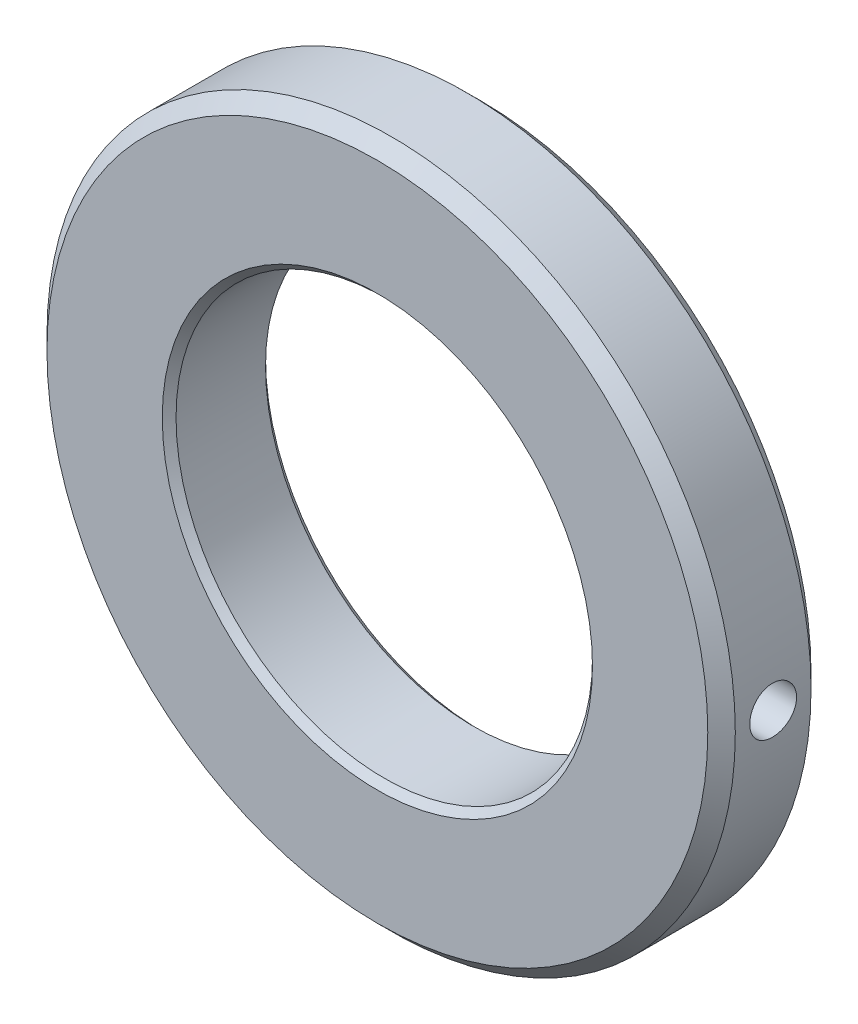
ISO-10303-21;
HEADER;
FILE_DESCRIPTION(('STEP AP214'),'2;1');
FILE_NAME('part.step','',(''),(''),'','','');
FILE_SCHEMA(('AUTOMOTIVE_DESIGN { 1 0 10303 214 1 1 1 1 }'));
ENDSEC;
DATA;
#1=APPLICATION_CONTEXT('core data for automotive mechanical design processes');
#2=APPLICATION_PROTOCOL_DEFINITION('international standard','automotive_design',2000,#1);
#3=PRODUCT_CONTEXT('',#1,'mechanical');
#4=PRODUCT('Part','Part','',(#3));
#5=PRODUCT_RELATED_PRODUCT_CATEGORY('part','',(#4));
#6=PRODUCT_DEFINITION_FORMATION('','',#4);
#7=PRODUCT_DEFINITION_CONTEXT('part definition',#1,'design');
#8=PRODUCT_DEFINITION('design','',#6,#7);
#9=PRODUCT_DEFINITION_SHAPE('','',#8);
#10=(LENGTH_UNIT() NAMED_UNIT(*) SI_UNIT(.MILLI.,.METRE.));
#11=(NAMED_UNIT(*) PLANE_ANGLE_UNIT() SI_UNIT($,.RADIAN.));
#12=(NAMED_UNIT(*) SI_UNIT($,.STERADIAN.) SOLID_ANGLE_UNIT());
#13=UNCERTAINTY_MEASURE_WITH_UNIT(LENGTH_MEASURE(1.E-05),#10,'distance_accuracy_value','');
#14=(GEOMETRIC_REPRESENTATION_CONTEXT(3) GLOBAL_UNCERTAINTY_ASSIGNED_CONTEXT((#13)) GLOBAL_UNIT_ASSIGNED_CONTEXT((#10,
#11,#12)) REPRESENTATION_CONTEXT('',''));
#15=CARTESIAN_POINT('',(0.,0.,0.));
#16=DIRECTION('',(0.,0.,1.));
#17=DIRECTION('',(1.,0.,0.));
#18=AXIS2_PLACEMENT_3D('',#15,#16,#17);
#19=CARTESIAN_POINT('',(0.,-1.11022302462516E-13,7.50000000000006));
#20=DIRECTION('',(0.,0.,0.999999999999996));
#21=DIRECTION('',(0.999999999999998,0.,0.));
#22=AXIS2_PLACEMENT_3D('',#19,#20,#21);
#23=PLANE('',#22);
#24=CARTESIAN_POINT('',(0.,-1.11022302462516E-13,7.50000000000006));
#25=DIRECTION('',(0.,0.,0.999999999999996));
#26=DIRECTION('',(0.999999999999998,0.,0.));
#27=AXIS2_PLACEMENT_3D('',#24,#25,#26);
#28=CIRCLE('',#27,48.);
#29=CARTESIAN_POINT('',(-47.9999999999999,-1.08357767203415E-13,7.50000000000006));
#30=VERTEX_POINT('',#29);
#31=EDGE_CURVE('E117',#30,#30,#28,.T.);
#32=ORIENTED_EDGE('',*,*,#31,.T.);
#33=EDGE_LOOP('',(#32));
#34=FACE_BOUND('',#33,.T.);
#35=CARTESIAN_POINT('',(0.,-1.11022302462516E-13,7.50000000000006));
#36=DIRECTION('',(0.,0.,0.999999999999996));
#37=DIRECTION('',(0.999999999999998,0.,0.));
#38=AXIS2_PLACEMENT_3D('',#35,#36,#37);
#39=CIRCLE('',#38,31.25);
#40=CARTESIAN_POINT('',(31.25,0.,7.50000000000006));
#41=VERTEX_POINT('',#40);
#42=EDGE_CURVE('E120',#41,#41,#39,.F.);
#43=ORIENTED_EDGE('',*,*,#42,.T.);
#44=EDGE_LOOP('',(#43));
#45=FACE_BOUND('',#44,.T.);
#46=ADVANCED_FACE('F40',(#34,#45),#23,.T.);
#47=CARTESIAN_POINT('',(0.,0.,-7.50000000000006));
#48=DIRECTION('',(0.,0.,0.999999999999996));
#49=DIRECTION('',(0.999999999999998,0.,0.));
#50=AXIS2_PLACEMENT_3D('',#47,#48,#49);
#51=PLANE('',#50);
#52=CARTESIAN_POINT('',(0.,0.,-7.50000000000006));
#53=DIRECTION('',(0.,0.,0.999999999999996));
#54=DIRECTION('',(0.999999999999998,0.,0.));
#55=AXIS2_PLACEMENT_3D('',#52,#53,#54);
#56=CIRCLE('',#55,48.);
#57=CARTESIAN_POINT('',(47.9999999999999,0.,-7.50000000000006));
#58=VERTEX_POINT('',#57);
#59=EDGE_CURVE('E11',#58,#58,#56,.F.);
#60=ORIENTED_EDGE('',*,*,#59,.T.);
#61=EDGE_LOOP('',(#60));
#62=FACE_BOUND('',#61,.T.);
#63=CARTESIAN_POINT('',(0.,0.,-7.50000000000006));
#64=DIRECTION('',(0.,0.,0.999999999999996));
#65=DIRECTION('',(0.999999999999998,0.,0.));
#66=AXIS2_PLACEMENT_3D('',#63,#64,#65);
#67=CIRCLE('',#66,31.25);
#68=CARTESIAN_POINT('',(-31.2499999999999,0.,-7.50000000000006));
#69=VERTEX_POINT('',#68);
#70=EDGE_CURVE('E122',#69,#69,#67,.T.);
#71=ORIENTED_EDGE('',*,*,#70,.T.);
#72=EDGE_LOOP('',(#71));
#73=FACE_BOUND('',#72,.T.);
#74=ADVANCED_FACE('F107',(#62,#73),#51,.F.);
#75=CARTESIAN_POINT('',(0.,-1.11022302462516E-13,7.50000000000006));
#76=DIRECTION('',(0.,0.,-0.999999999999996));
#77=DIRECTION('',(-0.999999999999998,0.,0.));
#78=AXIS2_PLACEMENT_3D('',#75,#76,#77);
#79=CYLINDRICAL_SURFACE('',#78,50.);
#80=CARTESIAN_POINT('',(50.,0.,-3.39999999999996));
#81=CARTESIAN_POINT('',(49.9999984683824,-0.190743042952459,-3.39999162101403));
#82=CARTESIAN_POINT('',(49.998896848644,-0.381618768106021,-3.38389476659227));
#83=CARTESIAN_POINT('',(49.9946081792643,-0.758097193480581,-3.31991367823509));
#84=CARTESIAN_POINT('',(49.9914187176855,-0.943693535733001,-3.27199267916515));
#85=CARTESIAN_POINT('',(49.9833150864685,-1.30410556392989,-3.14574829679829));
#86=CARTESIAN_POINT('',(49.9784018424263,-1.47892697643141,-3.06744122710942));
#87=CARTESIAN_POINT('',(49.9674028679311,-1.81289938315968,-2.88267467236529));
#88=CARTESIAN_POINT('',(49.9613174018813,-1.9720538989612,-2.77622153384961));
#89=CARTESIAN_POINT('',(49.9486458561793,-2.27049745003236,-2.53798189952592));
#90=CARTESIAN_POINT('',(49.9420590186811,-2.40975545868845,-2.40615657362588));
#91=CARTESIAN_POINT('',(49.9291335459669,-2.66418736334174,-2.12099531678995));
#92=CARTESIAN_POINT('',(49.9227949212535,-2.77936024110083,-1.96765847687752));
#93=CARTESIAN_POINT('',(49.9110747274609,-2.98245119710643,-1.64364724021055));
#94=CARTESIAN_POINT('',(49.9056940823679,-3.07034302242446,-1.47295635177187));
#95=CARTESIAN_POINT('',(49.8965066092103,-3.21620906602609,-1.11919774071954));
#96=CARTESIAN_POINT('',(49.8926997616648,-3.27418365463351,-0.93613017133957));
#97=CARTESIAN_POINT('',(49.8870965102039,-3.35848216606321,-0.563117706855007));
#98=CARTESIAN_POINT('',(49.8852969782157,-3.38485533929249,-0.3731839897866));
#99=CARTESIAN_POINT('',(49.8839019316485,-3.40535444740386,0.00842235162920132));
#100=CARTESIAN_POINT('',(49.884306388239,-3.3994808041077,0.200094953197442));
#101=CARTESIAN_POINT('',(49.887270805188,-3.35569383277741,0.579402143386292));
#102=CARTESIAN_POINT('',(49.8898271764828,-3.31783385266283,0.767042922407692));
#103=CARTESIAN_POINT('',(49.8968017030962,-3.211231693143,1.13329996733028));
#104=CARTESIAN_POINT('',(49.9012198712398,-3.14248930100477,1.31191617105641));
#105=CARTESIAN_POINT('',(49.911424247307,-2.97601329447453,1.65522487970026));
#106=CARTESIAN_POINT('',(49.9172115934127,-2.87825554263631,1.81990564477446));
#107=CARTESIAN_POINT('',(49.9295010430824,-2.65654126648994,2.13054044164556));
#108=CARTESIAN_POINT('',(49.9360031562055,-2.53258439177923,2.27649422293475));
#109=CARTESIAN_POINT('',(49.9490053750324,-2.26169038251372,2.54584229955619));
#110=CARTESIAN_POINT('',(49.9555054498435,-2.11470709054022,2.66919017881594));
#111=CARTESIAN_POINT('',(49.9677584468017,-1.80209418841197,2.88946682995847));
#112=CARTESIAN_POINT('',(49.9735113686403,-1.63646457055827,2.98639559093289));
#113=CARTESIAN_POINT('',(49.9836224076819,-1.29123200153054,3.15107887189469));
#114=CARTESIAN_POINT('',(49.9879804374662,-1.11162817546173,3.21883156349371));
#115=CARTESIAN_POINT('',(49.9948094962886,-0.743558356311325,3.32320809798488));
#116=CARTESIAN_POINT('',(49.9972805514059,-0.555092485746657,3.35983237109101));
#117=CARTESIAN_POINT('',(50.0000538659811,-0.175051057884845,3.40085476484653));
#118=CARTESIAN_POINT('',(50.0003604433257,0.0165175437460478,3.40531704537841));
#119=CARTESIAN_POINT('',(49.9987817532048,0.397680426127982,3.38205652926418));
#120=CARTESIAN_POINT('',(49.9968964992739,0.587274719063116,3.35433393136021));
#121=CARTESIAN_POINT('',(49.9911491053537,0.958925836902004,3.26754373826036));
#122=CARTESIAN_POINT('',(49.9872888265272,1.14098958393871,3.2085056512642));
#123=CARTESIAN_POINT('',(49.9780255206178,1.49262532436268,3.06079036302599));
#124=CARTESIAN_POINT('',(49.972622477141,1.66219718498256,2.97211284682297));
#125=CARTESIAN_POINT('',(49.960869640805,1.98432901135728,2.76747309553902));
#126=CARTESIAN_POINT('',(49.9545183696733,2.13686175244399,2.65146809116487));
#127=CARTESIAN_POINT('',(49.9415885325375,2.42031125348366,2.39552846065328));
#128=CARTESIAN_POINT('',(49.9350099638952,2.55122776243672,2.25559355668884));
#129=CARTESIAN_POINT('',(49.9223544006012,2.78794655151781,1.95548917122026));
#130=CARTESIAN_POINT('',(49.9162782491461,2.89370714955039,1.79528677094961));
#131=CARTESIAN_POINT('',(49.9053262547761,3.07682668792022,1.45936001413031));
#132=CARTESIAN_POINT('',(49.9004504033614,3.15418582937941,1.28363576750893));
#133=CARTESIAN_POINT('',(49.8924549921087,3.27823460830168,0.921804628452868));
#134=CARTESIAN_POINT('',(49.8893339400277,3.32495030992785,0.73570670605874));
#135=CARTESIAN_POINT('',(49.8851959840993,3.38647118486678,0.358286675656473));
#136=CARTESIAN_POINT('',(49.8841790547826,3.40127674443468,0.16696463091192));
#137=CARTESIAN_POINT('',(49.8843646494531,3.39855319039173,-0.215058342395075));
#138=CARTESIAN_POINT('',(49.88556267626,3.38108959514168,-0.405759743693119));
#139=CARTESIAN_POINT('',(49.890033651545,3.31445948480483,-0.781515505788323));
#140=CARTESIAN_POINT('',(49.8933066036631,3.26529291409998,-0.966569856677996));
#141=CARTESIAN_POINT('',(49.9015574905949,3.13666775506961,-1.32578691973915));
#142=CARTESIAN_POINT('',(49.9065353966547,3.05720967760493,-1.49994981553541));
#143=CARTESIAN_POINT('',(49.917635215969,2.87026546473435,-1.83247249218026));
#144=CARTESIAN_POINT('',(49.9237571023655,2.76277998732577,-1.9908326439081));
#145=CARTESIAN_POINT('',(49.9364696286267,2.52258822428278,-2.28758797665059));
#146=CARTESIAN_POINT('',(49.9430611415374,2.38983415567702,-2.42594444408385));
#147=CARTESIAN_POINT('',(49.9559625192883,2.10294578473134,-2.67845840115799));
#148=CARTESIAN_POINT('',(49.9622723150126,1.94880627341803,-2.79260997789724));
#149=CARTESIAN_POINT('',(49.973906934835,1.62331871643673,-2.99357383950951));
#150=CARTESIAN_POINT('',(49.9792303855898,1.45194718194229,-3.08034812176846));
#151=CARTESIAN_POINT('',(49.9882747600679,1.09715369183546,-3.22378424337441));
#152=CARTESIAN_POINT('',(49.9919975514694,0.913746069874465,-3.2804811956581));
#153=CARTESIAN_POINT('',(49.9964502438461,0.607687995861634,-3.34748701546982));
#154=CARTESIAN_POINT('',(49.9977754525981,0.487013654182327,-3.36715375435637));
#155=CARTESIAN_POINT('',(49.9995508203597,0.244244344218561,-3.3934129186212));
#156=CARTESIAN_POINT('',(50.0000009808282,0.12214937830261,-3.4000053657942));
#157=CARTESIAN_POINT('',(50.,0.,-3.39999999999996));
#158=B_SPLINE_CURVE_WITH_KNOTS('',3,(#80,#81,#82,#83,#84,#85,#86,#87,#88,#89,#90,#91,#92,#93,
#94,#95,#96,#97,#98,#99,#100,#101,#102,#103,#104,#105,#106,#107,#108,#109,#110,#111,#112,#113,
#114,#115,#116,#117,#118,#119,#120,#121,#122,#123,#124,#125,#126,#127,#128,#129,#130,#131,#132,
#133,#134,#135,#136,#137,#138,#139,#140,#141,#142,#143,#144,#145,#146,#147,#148,#149,#150,#151,
#152,#153,#154,#155,#156,#157),.UNSPECIFIED.,.T.,.F.,(4,2,2,2,2,2,2,2,2,2,2,2,2,2,2,2,2,2,2,2,2,
2,2,2,2,2,2,2,2,2,2,2,2,2,2,2,2,2,4),(0.,0.571783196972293,1.1442281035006,1.71636610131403,
2.28837519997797,2.86126677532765,3.43418256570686,4.00764798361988,4.58110630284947,
5.15366972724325,5.72622566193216,6.29782854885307,6.86943537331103,7.44151904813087,
8.01361037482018,8.58686351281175,9.16011688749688,9.73340618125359,10.3066875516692,
10.8788249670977,11.4509588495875,12.0225545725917,12.594156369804,13.1666587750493,
13.7391678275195,14.3126189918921,14.8860660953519,15.459024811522,16.0319765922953,
16.6037663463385,17.1755571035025,17.7473382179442,18.3191059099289,18.8919657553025,
19.4649653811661,20.038756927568,20.6118771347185,20.9780403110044,21.3442028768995),.UNSPECIFIED.);
#159=CARTESIAN_POINT('',(50.,-2.4980018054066E-13,3.39999999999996));
#160=VERTEX_POINT('',#159);
#161=CARTESIAN_POINT('',(50.,0.,-3.39999999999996));
#162=VERTEX_POINT('',#161);
#163=EDGE_CURVE('E58',#160,#162,#158,.T.);
#164=ORIENTED_EDGE('',*,*,#163,.T.);
#165=EDGE_CURVE('E56',#162,#160,#158,.T.);
#166=ORIENTED_EDGE('',*,*,#165,.T.);
#167=EDGE_LOOP('',(#164,#166));
#168=FACE_BOUND('',#167,.T.);
#169=CARTESIAN_POINT('',(0.,0.,5.50000000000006));
#170=DIRECTION('',(0.,0.,0.999999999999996));
#171=DIRECTION('',(0.999999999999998,0.,0.));
#172=AXIS2_PLACEMENT_3D('',#169,#170,#171);
#173=CIRCLE('',#172,50.);
#174=CARTESIAN_POINT('',(-49.9999999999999,-1.08246744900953E-13,5.50000000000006));
#175=VERTEX_POINT('',#174);
#176=EDGE_CURVE('E50',#175,#175,#173,.F.);
#177=ORIENTED_EDGE('',*,*,#176,.T.);
#178=EDGE_LOOP('',(#177));
#179=FACE_BOUND('',#178,.T.);
#180=CARTESIAN_POINT('',(0.,0.,-5.50000000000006));
#181=DIRECTION('',(0.,0.,0.999999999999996));
#182=DIRECTION('',(0.999999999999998,0.,0.));
#183=AXIS2_PLACEMENT_3D('',#180,#181,#182);
#184=CIRCLE('',#183,50.);
#185=CARTESIAN_POINT('',(49.9999999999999,0.,-5.50000000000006));
#186=VERTEX_POINT('',#185);
#187=EDGE_CURVE('E132',#186,#186,#184,.T.);
#188=ORIENTED_EDGE('',*,*,#187,.T.);
#189=EDGE_LOOP('',(#188));
#190=FACE_BOUND('',#189,.T.);
#191=ADVANCED_FACE('F42',(#168,#179,#190),#79,.T.);
#192=CARTESIAN_POINT('',(0.,-1.11022302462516E-13,7.50000000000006));
#193=DIRECTION('',(0.,0.,-0.999999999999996));
#194=DIRECTION('',(-0.999999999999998,0.,0.));
#195=AXIS2_PLACEMENT_3D('',#192,#193,#194);
#196=CYLINDRICAL_SURFACE('',#195,30.25);
#197=CARTESIAN_POINT('',(30.2500000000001,0.,-3.39999999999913));
#198=CARTESIAN_POINT('',(30.2499975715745,-0.190335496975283,-3.39999182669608));
#199=CARTESIAN_POINT('',(30.2481845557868,-0.380793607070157,-3.38396338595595));
#200=CARTESIAN_POINT('',(30.2411264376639,-0.756420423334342,-3.32026993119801));
#201=CARTESIAN_POINT('',(30.2358776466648,-0.941583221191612,-3.27257091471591));
#202=CARTESIAN_POINT('',(30.2225399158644,-1.3011262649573,-3.14695042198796));
#203=CARTESIAN_POINT('',(30.2144527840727,-1.47551329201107,-3.0690481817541));
#204=CARTESIAN_POINT('',(30.196340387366,-1.80870174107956,-2.88527223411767));
#205=CARTESIAN_POINT('',(30.1863154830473,-1.96750605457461,-2.77940372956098));
#206=CARTESIAN_POINT('',(30.1653984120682,-2.26577052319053,-2.54219095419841));
#207=CARTESIAN_POINT('',(30.1545029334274,-2.40515067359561,-2.41074637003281));
#208=CARTESIAN_POINT('',(30.1330997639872,-2.6599219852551,-2.12632746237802));
#209=CARTESIAN_POINT('',(30.122592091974,-2.77531198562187,-1.97335209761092));
#210=CARTESIAN_POINT('',(30.1031211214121,-2.97911832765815,-1.64970352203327));
#211=CARTESIAN_POINT('',(30.0941620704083,-3.06746097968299,-1.47898363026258));
#212=CARTESIAN_POINT('',(30.0788452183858,-3.21419436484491,-1.1250144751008));
#213=CARTESIAN_POINT('',(30.0724873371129,-3.27258602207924,-0.94176559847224));
#214=CARTESIAN_POINT('',(30.0631235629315,-3.35751967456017,-0.568763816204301));
#215=CARTESIAN_POINT('',(30.0601035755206,-3.38419562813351,-0.379041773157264));
#216=CARTESIAN_POINT('',(30.0577141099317,-3.40535493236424,0.00220867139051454));
#217=CARTESIAN_POINT('',(30.0583445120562,-3.39983933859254,0.193737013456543));
#218=CARTESIAN_POINT('',(30.0631717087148,-3.35688231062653,0.572235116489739));
#219=CARTESIAN_POINT('',(30.0673520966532,-3.31958774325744,0.759221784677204));
#220=CARTESIAN_POINT('',(30.0787826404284,-3.21436023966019,1.12426534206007));
#221=CARTESIAN_POINT('',(30.0860328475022,-3.14642679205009,1.30232208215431));
#222=CARTESIAN_POINT('',(30.1028048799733,-2.98168979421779,1.64491175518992));
#223=CARTESIAN_POINT('',(30.1123317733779,-2.88482171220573,1.80941339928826));
#224=CARTESIAN_POINT('',(30.1325796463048,-2.665011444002,2.11988067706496));
#225=CARTESIAN_POINT('',(30.1433006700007,-2.5420682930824,2.2658456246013));
#226=CARTESIAN_POINT('',(30.1648018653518,-2.27278047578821,2.53594908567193));
#227=CARTESIAN_POINT('',(30.1755820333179,-2.12630908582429,2.65996129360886));
#228=CARTESIAN_POINT('',(30.1959306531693,-1.81456086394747,2.88165796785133));
#229=CARTESIAN_POINT('',(30.2054991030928,-1.64928400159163,2.97934239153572));
#230=CARTESIAN_POINT('',(30.2223505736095,-1.30452429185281,3.14560794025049));
#231=CARTESIAN_POINT('',(30.2296330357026,-1.12503798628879,3.21418195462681));
#232=CARTESIAN_POINT('',(30.2410866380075,-0.756998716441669,3.32018395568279));
#233=CARTESIAN_POINT('',(30.2452578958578,-0.568446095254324,3.35761311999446));
#234=CARTESIAN_POINT('',(30.2500039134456,-0.188719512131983,3.40010108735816));
#235=CARTESIAN_POINT('',(30.2505980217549,0.00243473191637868,3.40533404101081));
#236=CARTESIAN_POINT('',(30.248174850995,0.382897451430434,3.38373946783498));
#237=CARTESIAN_POINT('',(30.2451576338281,0.572205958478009,3.35691249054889));
#238=CARTESIAN_POINT('',(30.2358630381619,0.943095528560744,3.27210415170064));
#239=CARTESIAN_POINT('',(30.2295942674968,1.1246956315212,3.21420503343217));
#240=CARTESIAN_POINT('',(30.2144991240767,1.47560705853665,3.06898093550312));
#241=CARTESIAN_POINT('',(30.2056726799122,1.64491803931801,2.98165513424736));
#242=CARTESIAN_POINT('',(30.1863996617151,1.96722800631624,2.77962958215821));
#243=CARTESIAN_POINT('',(30.175946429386,2.12015538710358,2.66481623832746));
#244=CARTESIAN_POINT('',(30.1546122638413,2.40463055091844,2.41123658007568));
#245=CARTESIAN_POINT('',(30.1437313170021,2.53617765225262,2.2724695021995));
#246=CARTESIAN_POINT('',(30.1227091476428,2.77476900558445,1.97415814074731));
#247=CARTESIAN_POINT('',(30.1125715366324,2.88169841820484,1.81452171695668));
#248=CARTESIAN_POINT('',(30.0942410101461,3.06722778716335,1.47945414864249));
#249=CARTESIAN_POINT('',(30.0860480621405,3.14582821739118,1.30402326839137));
#250=CARTESIAN_POINT('',(30.0725581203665,3.27227914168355,0.942729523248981));
#251=CARTESIAN_POINT('',(30.0672548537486,3.32019628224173,0.756890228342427));
#252=CARTESIAN_POINT('',(30.0601260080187,3.38413595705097,0.379740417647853));
#253=CARTESIAN_POINT('',(30.0583003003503,3.40015967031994,0.18843010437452));
#254=CARTESIAN_POINT('',(30.0583365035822,3.3998388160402,-0.193089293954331));
#255=CARTESIAN_POINT('',(30.0601778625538,3.3836746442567,-0.383298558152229));
#256=CARTESIAN_POINT('',(30.0672967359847,3.31981686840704,-0.758279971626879));
#257=CARTESIAN_POINT('',(30.0725742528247,3.27212324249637,-0.943052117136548));
#258=CARTESIAN_POINT('',(30.0859647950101,3.1466133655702,-1.30190230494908));
#259=CARTESIAN_POINT('',(30.0940771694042,3.06880402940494,-1.47598279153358));
#260=CARTESIAN_POINT('',(30.1122245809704,2.88528948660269,-1.8086435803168));
#261=CARTESIAN_POINT('',(30.1222596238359,2.77958419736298,-1.96722383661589));
#262=CARTESIAN_POINT('',(30.1431891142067,2.5426041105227,-2.26530645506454));
#263=CARTESIAN_POINT('',(30.1540878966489,2.41119475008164,-2.40470153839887));
#264=CARTESIAN_POINT('',(30.1754777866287,2.12681191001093,-2.65953537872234));
#265=CARTESIAN_POINT('',(30.1859687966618,1.97383331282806,-2.77496843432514));
#266=CARTESIAN_POINT('',(30.2053961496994,1.65012033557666,-2.97889638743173));
#267=CARTESIAN_POINT('',(30.2143275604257,1.47933225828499,-3.06730646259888));
#268=CARTESIAN_POINT('',(30.2295778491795,1.12533645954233,-3.21407085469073));
#269=CARTESIAN_POINT('',(30.2358996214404,0.94214276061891,-3.27245848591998));
#270=CARTESIAN_POINT('',(30.2436599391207,0.631627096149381,-3.34323304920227));
#271=CARTESIAN_POINT('',(30.2460261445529,0.506278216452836,-3.36449087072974));
#272=CARTESIAN_POINT('',(30.2491969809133,0.253971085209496,-3.39287703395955));
#273=CARTESIAN_POINT('',(30.2500016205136,0.127012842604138,-3.40000545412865));
#274=CARTESIAN_POINT('',(30.2500000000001,0.,-3.39999999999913));
#275=B_SPLINE_CURVE_WITH_KNOTS('',3,(#197,#198,#199,#200,#201,#202,#203,#204,#205,#206,#207,
#208,#209,#210,#211,#212,#213,#214,#215,#216,#217,#218,#219,#220,#221,#222,#223,#224,#225,#226,
#227,#228,#229,#230,#231,#232,#233,#234,#235,#236,#237,#238,#239,#240,#241,#242,#243,#244,#245,
#246,#247,#248,#249,#250,#251,#252,#253,#254,#255,#256,#257,#258,#259,#260,#261,#262,#263,#264,
#265,#266,#267,#268,#269,#270,#271,#272,#273,#274),.UNSPECIFIED.,.T.,.F.,(4,2,2,2,2,2,2,2,2,2,2,
2,2,2,2,2,2,2,2,2,2,2,2,2,2,2,2,2,2,2,2,2,2,2,2,2,2,2,4),(0.,0.570542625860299,1.14169879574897,
1.71249180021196,2.28317868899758,2.85615073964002,3.42915051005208,4.00369778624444,
4.57822733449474,5.15032150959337,5.72239692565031,6.2918427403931,6.86129805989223,
7.43203301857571,8.00278909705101,8.57672924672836,9.15067032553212,9.72475151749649,
10.2988110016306,10.86976262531,11.4407044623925,12.010142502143,12.5795964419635,
13.1514455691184,13.7233129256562,14.2977962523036,14.8722699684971,15.445491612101,
16.0186920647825,16.5886890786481,17.1586864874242,17.7285530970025,18.2984213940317,
18.871356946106,19.444428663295,20.019281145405,20.5934943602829,20.9742254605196,
21.3549544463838),.UNSPECIFIED.);
#276=CARTESIAN_POINT('',(30.2500000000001,0.,-3.39999999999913));
#277=VERTEX_POINT('',#276);
#278=EDGE_CURVE('E62',#277,#277,#275,.T.);
#279=ORIENTED_EDGE('',*,*,#278,.F.);
#280=EDGE_LOOP('',(#279));
#281=FACE_BOUND('',#280,.T.);
#282=CARTESIAN_POINT('',(0.,0.,6.49999999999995));
#283=DIRECTION('',(0.,0.,0.999999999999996));
#284=DIRECTION('',(0.999999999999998,0.,0.));
#285=AXIS2_PLACEMENT_3D('',#282,#283,#284);
#286=CIRCLE('',#285,30.25);
#287=CARTESIAN_POINT('',(30.2499999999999,0.,6.49999999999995));
#288=VERTEX_POINT('',#287);
#289=EDGE_CURVE('E71',#288,#288,#286,.T.);
#290=ORIENTED_EDGE('',*,*,#289,.T.);
#291=EDGE_LOOP('',(#290));
#292=FACE_BOUND('',#291,.T.);
#293=CARTESIAN_POINT('',(0.,0.,-6.49999999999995));
#294=DIRECTION('',(0.,0.,0.999999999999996));
#295=DIRECTION('',(0.999999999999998,0.,0.));
#296=AXIS2_PLACEMENT_3D('',#293,#294,#295);
#297=CIRCLE('',#296,30.25);
#298=CARTESIAN_POINT('',(-30.2499999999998,0.,-6.49999999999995));
#299=VERTEX_POINT('',#298);
#300=EDGE_CURVE('E66',#299,#299,#297,.F.);
#301=ORIENTED_EDGE('',*,*,#300,.T.);
#302=EDGE_LOOP('',(#301));
#303=FACE_BOUND('',#302,.T.);
#304=ADVANCED_FACE('F102',(#281,#292,#303),#196,.F.);
#305=CARTESIAN_POINT('',(0.,0.,6.49999999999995));
#306=DIRECTION('',(0.,0.,0.999999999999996));
#307=DIRECTION('',(0.999999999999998,0.,0.));
#308=AXIS2_PLACEMENT_3D('',#305,#306,#307);
#309=CONICAL_SURFACE('',#308,30.25,0.78539816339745);
#310=CARTESIAN_POINT('',(31.25,0.,7.50000000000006));
#311=CARTESIAN_POINT('',(31.2395833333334,0.,7.48958333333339));
#312=CARTESIAN_POINT('',(31.2291666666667,0.,7.47916666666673));
#313=CARTESIAN_POINT('',(31.2083333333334,0.,7.45833333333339));
#314=CARTESIAN_POINT('',(31.1979166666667,0.,7.44791666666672));
#315=CARTESIAN_POINT('',(31.1770833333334,0.,7.42708333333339));
#316=CARTESIAN_POINT('',(31.1666666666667,0.,7.41666666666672));
#317=CARTESIAN_POINT('',(31.1458333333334,0.,7.39583333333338));
#318=CARTESIAN_POINT('',(31.1354166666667,0.,7.38541666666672));
#319=CARTESIAN_POINT('',(31.1145833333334,0.,7.36458333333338));
#320=CARTESIAN_POINT('',(31.1041666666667,0.,7.35416666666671));
#321=CARTESIAN_POINT('',(31.0833333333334,0.,7.33333333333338));
#322=CARTESIAN_POINT('',(31.0729166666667,0.,7.32291666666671));
#323=CARTESIAN_POINT('',(31.0520833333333,0.,7.30208333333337));
#324=CARTESIAN_POINT('',(31.0416666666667,0.,7.29166666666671));
#325=CARTESIAN_POINT('',(31.0208333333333,0.,7.27083333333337));
#326=CARTESIAN_POINT('',(31.0104166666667,0.,7.2604166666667));
#327=CARTESIAN_POINT('',(30.9895833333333,0.,7.23958333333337));
#328=CARTESIAN_POINT('',(30.9791666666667,0.,7.2291666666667));
#329=CARTESIAN_POINT('',(30.9583333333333,0.,7.20833333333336));
#330=CARTESIAN_POINT('',(30.9479166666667,0.,7.19791666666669));
#331=CARTESIAN_POINT('',(30.9270833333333,0.,7.17708333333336));
#332=CARTESIAN_POINT('',(30.9166666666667,0.,7.16666666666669));
#333=CARTESIAN_POINT('',(30.8958333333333,0.,7.14583333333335));
#334=CARTESIAN_POINT('',(30.8854166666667,0.,7.13541666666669));
#335=CARTESIAN_POINT('',(30.8645833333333,0.,7.11458333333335));
#336=CARTESIAN_POINT('',(30.8541666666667,0.,7.10416666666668));
#337=CARTESIAN_POINT('',(30.8333333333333,0.,7.08333333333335));
#338=CARTESIAN_POINT('',(30.8229166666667,0.,7.07291666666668));
#339=CARTESIAN_POINT('',(30.8020833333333,0.,7.05208333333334));
#340=CARTESIAN_POINT('',(30.7916666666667,0.,7.04166666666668));
#341=CARTESIAN_POINT('',(30.7708333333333,0.,7.02083333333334));
#342=CARTESIAN_POINT('',(30.7604166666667,0.,7.01041666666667));
#343=CARTESIAN_POINT('',(30.7395833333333,0.,6.98958333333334));
#344=CARTESIAN_POINT('',(30.7291666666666,0.,6.97916666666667));
#345=CARTESIAN_POINT('',(30.7083333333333,0.,6.95833333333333));
#346=CARTESIAN_POINT('',(30.6979166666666,0.,6.94791666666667));
#347=CARTESIAN_POINT('',(30.6770833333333,0.,6.92708333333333));
#348=CARTESIAN_POINT('',(30.6666666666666,0.,6.91666666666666));
#349=CARTESIAN_POINT('',(30.6458333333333,0.,6.89583333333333));
#350=CARTESIAN_POINT('',(30.6354166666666,0.,6.88541666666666));
#351=CARTESIAN_POINT('',(30.6145833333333,0.,6.86458333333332));
#352=CARTESIAN_POINT('',(30.6041666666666,0.,6.85416666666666));
#353=CARTESIAN_POINT('',(30.5833333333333,0.,6.83333333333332));
#354=CARTESIAN_POINT('',(30.5729166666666,0.,6.82291666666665));
#355=CARTESIAN_POINT('',(30.5520833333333,0.,6.80208333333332));
#356=CARTESIAN_POINT('',(30.5416666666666,0.,6.79166666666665));
#357=CARTESIAN_POINT('',(30.5208333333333,0.,6.77083333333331));
#358=CARTESIAN_POINT('',(30.5104166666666,0.,6.76041666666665));
#359=CARTESIAN_POINT('',(30.4895833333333,0.,6.73958333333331));
#360=CARTESIAN_POINT('',(30.4791666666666,0.,6.72916666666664));
#361=CARTESIAN_POINT('',(30.4583333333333,0.,6.70833333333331));
#362=CARTESIAN_POINT('',(30.4479166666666,0.,6.69791666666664));
#363=CARTESIAN_POINT('',(30.4270833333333,0.,6.6770833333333));
#364=CARTESIAN_POINT('',(30.4166666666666,0.,6.66666666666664));
#365=CARTESIAN_POINT('',(30.3958333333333,0.,6.6458333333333));
#366=CARTESIAN_POINT('',(30.3854166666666,0.,6.63541666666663));
#367=CARTESIAN_POINT('',(30.3645833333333,0.,6.61458333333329));
#368=CARTESIAN_POINT('',(30.3541666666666,0.,6.60416666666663));
#369=CARTESIAN_POINT('',(30.3333333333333,0.,6.58333333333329));
#370=CARTESIAN_POINT('',(30.3229166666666,0.,6.57291666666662));
#371=CARTESIAN_POINT('',(30.3020833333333,0.,6.55208333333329));
#372=CARTESIAN_POINT('',(30.2916666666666,0.,6.54166666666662));
#373=CARTESIAN_POINT('',(30.2708333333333,0.,6.52083333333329));
#374=CARTESIAN_POINT('',(30.2604166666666,0.,6.51041666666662));
#375=CARTESIAN_POINT('',(30.2499999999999,0.,6.49999999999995));
#376=B_SPLINE_CURVE_WITH_KNOTS('',3,(#310,#311,#312,#313,#314,#315,#316,#317,#318,#319,#320,
#321,#322,#323,#324,#325,#326,#327,#328,#329,#330,#331,#332,#333,#334,#335,#336,#337,#338,#339,
#340,#341,#342,#343,#344,#345,#346,#347,#348,#349,#350,#351,#352,#353,#354,#355,#356,#357,#358,
#359,#360,#361,#362,#363,#364,#365,#366,#367,#368,#369,#370,#371,#372,#373,#374,#375),
.UNSPECIFIED.,.F.,.F.,(4,2,2,2,2,2,2,2,2,2,2,2,2,2,2,2,2,2,2,2,2,2,2,2,2,2,2,2,2,2,2,2,4),(0.,
0.0441941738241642,0.0883883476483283,0.132582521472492,0.176776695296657,0.220970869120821,
0.265165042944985,0.309359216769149,0.353553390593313,0.39774756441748,0.441941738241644,
0.486135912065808,0.530330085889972,0.574524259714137,0.618718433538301,0.662912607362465,
0.707106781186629,0.751300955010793,0.795495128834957,0.839689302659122,0.883883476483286,
0.92807765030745,0.972271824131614,1.01646599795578,1.06066017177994,1.10485434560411,
1.14904851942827,1.19324269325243,1.2374368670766,1.28163104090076,1.32582521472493,
1.37001938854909,1.41421356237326),.UNSPECIFIED.);
#377=EDGE_CURVE('BSEAM98',#41,#288,#376,.T.);
#378=ORIENTED_EDGE('',*,*,#42,.F.);
#379=ORIENTED_EDGE('',*,*,#289,.F.);
#380=ORIENTED_EDGE('',*,*,#377,.T.);
#381=ORIENTED_EDGE('',*,*,#377,.F.);
#382=EDGE_LOOP('',(#378,#380,#379,#381));
#383=FACE_BOUND('',#382,.T.);
#384=ADVANCED_FACE('F98',(#383),#309,.F.);
#385=CARTESIAN_POINT('',(0.,0.,-7.50000000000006));
#386=DIRECTION('',(0.,0.,-0.999999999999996));
#387=DIRECTION('',(-0.999999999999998,0.,0.));
#388=AXIS2_PLACEMENT_3D('',#385,#386,#387);
#389=CONICAL_SURFACE('',#388,31.25,0.785398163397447);
#390=CARTESIAN_POINT('',(-30.2499999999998,0.,-6.49999999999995));
#391=CARTESIAN_POINT('',(-30.2604166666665,0.,-6.51041666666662));
#392=CARTESIAN_POINT('',(-30.2708333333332,0.,-6.52083333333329));
#393=CARTESIAN_POINT('',(-30.2916666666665,0.,-6.54166666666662));
#394=CARTESIAN_POINT('',(-30.3020833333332,0.,-6.55208333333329));
#395=CARTESIAN_POINT('',(-30.3229166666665,0.,-6.57291666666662));
#396=CARTESIAN_POINT('',(-30.3333333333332,0.,-6.58333333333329));
#397=CARTESIAN_POINT('',(-30.3541666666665,0.,-6.60416666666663));
#398=CARTESIAN_POINT('',(-30.3645833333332,0.,-6.61458333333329));
#399=CARTESIAN_POINT('',(-30.3854166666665,0.,-6.63541666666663));
#400=CARTESIAN_POINT('',(-30.3958333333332,0.,-6.6458333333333));
#401=CARTESIAN_POINT('',(-30.4166666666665,0.,-6.66666666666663));
#402=CARTESIAN_POINT('',(-30.4270833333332,0.,-6.6770833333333));
#403=CARTESIAN_POINT('',(-30.4479166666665,0.,-6.69791666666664));
#404=CARTESIAN_POINT('',(-30.4583333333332,0.,-6.70833333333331));
#405=CARTESIAN_POINT('',(-30.4791666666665,0.,-6.72916666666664));
#406=CARTESIAN_POINT('',(-30.4895833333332,0.,-6.73958333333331));
#407=CARTESIAN_POINT('',(-30.5104166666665,0.,-6.76041666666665));
#408=CARTESIAN_POINT('',(-30.5208333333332,0.,-6.77083333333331));
#409=CARTESIAN_POINT('',(-30.5416666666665,0.,-6.79166666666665));
#410=CARTESIAN_POINT('',(-30.5520833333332,0.,-6.80208333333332));
#411=CARTESIAN_POINT('',(-30.5729166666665,0.,-6.82291666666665));
#412=CARTESIAN_POINT('',(-30.5833333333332,0.,-6.83333333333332));
#413=CARTESIAN_POINT('',(-30.6041666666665,0.,-6.85416666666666));
#414=CARTESIAN_POINT('',(-30.6145833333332,0.,-6.86458333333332));
#415=CARTESIAN_POINT('',(-30.6354166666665,0.,-6.88541666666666));
#416=CARTESIAN_POINT('',(-30.6458333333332,0.,-6.89583333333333));
#417=CARTESIAN_POINT('',(-30.6666666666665,0.,-6.91666666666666));
#418=CARTESIAN_POINT('',(-30.6770833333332,0.,-6.92708333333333));
#419=CARTESIAN_POINT('',(-30.6979166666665,0.,-6.94791666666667));
#420=CARTESIAN_POINT('',(-30.7083333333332,0.,-6.95833333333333));
#421=CARTESIAN_POINT('',(-30.7291666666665,0.,-6.97916666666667));
#422=CARTESIAN_POINT('',(-30.7395833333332,0.,-6.98958333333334));
#423=CARTESIAN_POINT('',(-30.7604166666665,0.,-7.01041666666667));
#424=CARTESIAN_POINT('',(-30.7708333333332,0.,-7.02083333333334));
#425=CARTESIAN_POINT('',(-30.7916666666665,0.,-7.04166666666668));
#426=CARTESIAN_POINT('',(-30.8020833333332,0.,-7.05208333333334));
#427=CARTESIAN_POINT('',(-30.8229166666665,0.,-7.07291666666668));
#428=CARTESIAN_POINT('',(-30.8333333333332,0.,-7.08333333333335));
#429=CARTESIAN_POINT('',(-30.8541666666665,0.,-7.10416666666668));
#430=CARTESIAN_POINT('',(-30.8645833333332,0.,-7.11458333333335));
#431=CARTESIAN_POINT('',(-30.8854166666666,0.,-7.13541666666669));
#432=CARTESIAN_POINT('',(-30.8958333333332,0.,-7.14583333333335));
#433=CARTESIAN_POINT('',(-30.9166666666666,0.,-7.16666666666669));
#434=CARTESIAN_POINT('',(-30.9270833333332,0.,-7.17708333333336));
#435=CARTESIAN_POINT('',(-30.9479166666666,0.,-7.1979166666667));
#436=CARTESIAN_POINT('',(-30.9583333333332,0.,-7.20833333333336));
#437=CARTESIAN_POINT('',(-30.9791666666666,0.,-7.2291666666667));
#438=CARTESIAN_POINT('',(-30.9895833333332,0.,-7.23958333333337));
#439=CARTESIAN_POINT('',(-31.0104166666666,0.,-7.2604166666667));
#440=CARTESIAN_POINT('',(-31.0208333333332,0.,-7.27083333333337));
#441=CARTESIAN_POINT('',(-31.0416666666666,0.,-7.29166666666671));
#442=CARTESIAN_POINT('',(-31.0520833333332,0.,-7.30208333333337));
#443=CARTESIAN_POINT('',(-31.0729166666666,0.,-7.32291666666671));
#444=CARTESIAN_POINT('',(-31.0833333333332,0.,-7.33333333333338));
#445=CARTESIAN_POINT('',(-31.1041666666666,0.,-7.35416666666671));
#446=CARTESIAN_POINT('',(-31.1145833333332,0.,-7.36458333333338));
#447=CARTESIAN_POINT('',(-31.1354166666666,0.,-7.38541666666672));
#448=CARTESIAN_POINT('',(-31.1458333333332,0.,-7.39583333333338));
#449=CARTESIAN_POINT('',(-31.1666666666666,0.,-7.41666666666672));
#450=CARTESIAN_POINT('',(-31.1770833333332,0.,-7.42708333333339));
#451=CARTESIAN_POINT('',(-31.1979166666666,0.,-7.44791666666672));
#452=CARTESIAN_POINT('',(-31.2083333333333,0.,-7.45833333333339));
#453=CARTESIAN_POINT('',(-31.2291666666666,0.,-7.47916666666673));
#454=CARTESIAN_POINT('',(-31.2395833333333,0.,-7.48958333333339));
#455=CARTESIAN_POINT('',(-31.2499999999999,0.,-7.50000000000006));
#456=B_SPLINE_CURVE_WITH_KNOTS('',3,(#390,#391,#392,#393,#394,#395,#396,#397,#398,#399,#400,
#401,#402,#403,#404,#405,#406,#407,#408,#409,#410,#411,#412,#413,#414,#415,#416,#417,#418,#419,
#420,#421,#422,#423,#424,#425,#426,#427,#428,#429,#430,#431,#432,#433,#434,#435,#436,#437,#438,
#439,#440,#441,#442,#443,#444,#445,#446,#447,#448,#449,#450,#451,#452,#453,#454,#455),
.UNSPECIFIED.,.F.,.F.,(4,2,2,2,2,2,2,2,2,2,2,2,2,2,2,2,2,2,2,2,2,2,2,2,2,2,2,2,2,2,2,2,4),(0.,
0.0441941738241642,0.0883883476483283,0.132582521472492,0.176776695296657,0.220970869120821,
0.265165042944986,0.309359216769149,0.353553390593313,0.397747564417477,0.441941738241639,
0.486135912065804,0.530330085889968,0.574524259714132,0.618718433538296,0.662912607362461,
0.707106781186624,0.751300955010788,0.795495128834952,0.839689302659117,0.883883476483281,
0.928077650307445,0.97227182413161,1.01646599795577,1.06066017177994,1.1048543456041,
1.14904851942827,1.19324269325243,1.23743686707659,1.28163104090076,1.32582521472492,
1.37001938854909,1.41421356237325),.UNSPECIFIED.);
#457=EDGE_CURVE('BSEAM94',#299,#69,#456,.T.);
#458=ORIENTED_EDGE('',*,*,#300,.F.);
#459=ORIENTED_EDGE('',*,*,#70,.F.);
#460=ORIENTED_EDGE('',*,*,#457,.T.);
#461=ORIENTED_EDGE('',*,*,#457,.F.);
#462=EDGE_LOOP('',(#458,#460,#459,#461));
#463=FACE_BOUND('',#462,.T.);
#464=ADVANCED_FACE('F94',(#463),#389,.F.);
#465=CARTESIAN_POINT('',(0.,-1.11022302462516E-13,7.50000000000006));
#466=DIRECTION('',(0.,0.,-0.999999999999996));
#467=DIRECTION('',(-0.999999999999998,0.,0.));
#468=AXIS2_PLACEMENT_3D('',#465,#466,#467);
#469=CONICAL_SURFACE('',#468,48.,0.785398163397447);
#470=CARTESIAN_POINT('',(-49.9999999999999,-1.08246744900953E-13,5.50000000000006));
#471=CARTESIAN_POINT('',(-49.9791666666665,-1.0824790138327E-13,5.5208333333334));
#472=CARTESIAN_POINT('',(-49.9583333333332,-1.08249057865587E-13,5.54166666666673));
#473=CARTESIAN_POINT('',(-49.9166666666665,-1.08251370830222E-13,5.58333333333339));
#474=CARTESIAN_POINT('',(-49.8958333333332,-1.08252527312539E-13,5.60416666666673));
#475=CARTESIAN_POINT('',(-49.8541666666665,-1.08254840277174E-13,5.64583333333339));
#476=CARTESIAN_POINT('',(-49.8333333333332,-1.08255996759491E-13,5.66666666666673));
#477=CARTESIAN_POINT('',(-49.7916666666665,-1.08258309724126E-13,5.7083333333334));
#478=CARTESIAN_POINT('',(-49.7708333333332,-1.08259466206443E-13,5.72916666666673));
#479=CARTESIAN_POINT('',(-49.7291666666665,-1.08261779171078E-13,5.77083333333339));
#480=CARTESIAN_POINT('',(-49.7083333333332,-1.08262935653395E-13,5.79166666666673));
#481=CARTESIAN_POINT('',(-49.6666666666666,-1.0826524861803E-13,5.8333333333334));
#482=CARTESIAN_POINT('',(-49.6458333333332,-1.08266405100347E-13,5.85416666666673));
#483=CARTESIAN_POINT('',(-49.6041666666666,-1.08268718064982E-13,5.89583333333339));
#484=CARTESIAN_POINT('',(-49.5833333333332,-1.08269874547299E-13,5.91666666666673));
#485=CARTESIAN_POINT('',(-49.5416666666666,-1.08272187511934E-13,5.95833333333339));
#486=CARTESIAN_POINT('',(-49.5208333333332,-1.08273343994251E-13,5.97916666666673));
#487=CARTESIAN_POINT('',(-49.4791666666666,-1.08275656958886E-13,6.02083333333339));
#488=CARTESIAN_POINT('',(-49.4583333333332,-1.08276813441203E-13,6.04166666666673));
#489=CARTESIAN_POINT('',(-49.4166666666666,-1.08279126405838E-13,6.08333333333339));
#490=CARTESIAN_POINT('',(-49.3958333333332,-1.08280282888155E-13,6.10416666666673));
#491=CARTESIAN_POINT('',(-49.3541666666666,-1.0828259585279E-13,6.1458333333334));
#492=CARTESIAN_POINT('',(-49.3333333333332,-1.08283752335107E-13,6.16666666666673));
#493=CARTESIAN_POINT('',(-49.2916666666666,-1.08286065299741E-13,6.20833333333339));
#494=CARTESIAN_POINT('',(-49.2708333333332,-1.08287221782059E-13,6.22916666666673));
#495=CARTESIAN_POINT('',(-49.2291666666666,-1.08289534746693E-13,6.27083333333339));
#496=CARTESIAN_POINT('',(-49.2083333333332,-1.08290691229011E-13,6.29166666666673));
#497=CARTESIAN_POINT('',(-49.1666666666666,-1.08293004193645E-13,6.33333333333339));
#498=CARTESIAN_POINT('',(-49.1458333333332,-1.08294160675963E-13,6.35416666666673));
#499=CARTESIAN_POINT('',(-49.1041666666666,-1.08296473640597E-13,6.3958333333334));
#500=CARTESIAN_POINT('',(-49.0833333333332,-1.08297630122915E-13,6.41666666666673));
#501=CARTESIAN_POINT('',(-49.0416666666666,-1.08299943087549E-13,6.4583333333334));
#502=CARTESIAN_POINT('',(-49.0208333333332,-1.08301099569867E-13,6.47916666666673));
#503=CARTESIAN_POINT('',(-48.9791666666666,-1.08303412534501E-13,6.5208333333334));
#504=CARTESIAN_POINT('',(-48.9583333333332,-1.08304569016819E-13,6.54166666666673));
#505=CARTESIAN_POINT('',(-48.9166666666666,-1.08306881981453E-13,6.5833333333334));
#506=CARTESIAN_POINT('',(-48.8958333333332,-1.08308038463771E-13,6.60416666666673));
#507=CARTESIAN_POINT('',(-48.8541666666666,-1.08310351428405E-13,6.6458333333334));
#508=CARTESIAN_POINT('',(-48.8333333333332,-1.08311507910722E-13,6.66666666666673));
#509=CARTESIAN_POINT('',(-48.7916666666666,-1.08313820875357E-13,6.7083333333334));
#510=CARTESIAN_POINT('',(-48.7708333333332,-1.08314977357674E-13,6.72916666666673));
#511=CARTESIAN_POINT('',(-48.7291666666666,-1.08317290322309E-13,6.7708333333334));
#512=CARTESIAN_POINT('',(-48.7083333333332,-1.08318446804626E-13,6.79166666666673));
#513=CARTESIAN_POINT('',(-48.6666666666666,-1.08320759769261E-13,6.8333333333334));
#514=CARTESIAN_POINT('',(-48.6458333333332,-1.08321916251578E-13,6.85416666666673));
#515=CARTESIAN_POINT('',(-48.6041666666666,-1.08324229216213E-13,6.8958333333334));
#516=CARTESIAN_POINT('',(-48.5833333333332,-1.0832538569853E-13,6.91666666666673));
#517=CARTESIAN_POINT('',(-48.5416666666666,-1.08327698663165E-13,6.9583333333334));
#518=CARTESIAN_POINT('',(-48.5208333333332,-1.08328855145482E-13,6.97916666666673));
#519=CARTESIAN_POINT('',(-48.4791666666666,-1.08331168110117E-13,7.0208333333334));
#520=CARTESIAN_POINT('',(-48.4583333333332,-1.08332324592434E-13,7.04166666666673));
#521=CARTESIAN_POINT('',(-48.4166666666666,-1.08334637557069E-13,7.0833333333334));
#522=CARTESIAN_POINT('',(-48.3958333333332,-1.08335794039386E-13,7.10416666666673));
#523=CARTESIAN_POINT('',(-48.3541666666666,-1.08338107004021E-13,7.1458333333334));
#524=CARTESIAN_POINT('',(-48.3333333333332,-1.08339263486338E-13,7.16666666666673));
#525=CARTESIAN_POINT('',(-48.2916666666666,-1.08341576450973E-13,7.2083333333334));
#526=CARTESIAN_POINT('',(-48.2708333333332,-1.0834273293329E-13,7.22916666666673));
#527=CARTESIAN_POINT('',(-48.2291666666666,-1.08345045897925E-13,7.2708333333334));
#528=CARTESIAN_POINT('',(-48.2083333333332,-1.08346202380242E-13,7.29166666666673));
#529=CARTESIAN_POINT('',(-48.1666666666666,-1.08348515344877E-13,7.3333333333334));
#530=CARTESIAN_POINT('',(-48.1458333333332,-1.08349671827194E-13,7.35416666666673));
#531=CARTESIAN_POINT('',(-48.1041666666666,-1.08351984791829E-13,7.3958333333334));
#532=CARTESIAN_POINT('',(-48.0833333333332,-1.08353141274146E-13,7.41666666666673));
#533=CARTESIAN_POINT('',(-48.0416666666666,-1.08355454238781E-13,7.4583333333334));
#534=CARTESIAN_POINT('',(-48.0208333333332,-1.08356610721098E-13,7.47916666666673));
#535=CARTESIAN_POINT('',(-47.9999999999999,-1.08357767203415E-13,7.50000000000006));
#536=B_SPLINE_CURVE_WITH_KNOTS('',3,(#470,#471,#472,#473,#474,#475,#476,#477,#478,#479,#480,
#481,#482,#483,#484,#485,#486,#487,#488,#489,#490,#491,#492,#493,#494,#495,#496,#497,#498,#499,
#500,#501,#502,#503,#504,#505,#506,#507,#508,#509,#510,#511,#512,#513,#514,#515,#516,#517,#518,
#519,#520,#521,#522,#523,#524,#525,#526,#527,#528,#529,#530,#531,#532,#533,#534,#535),
.UNSPECIFIED.,.F.,.F.,(4,2,2,2,2,2,2,2,2,2,2,2,2,2,2,2,2,2,2,2,2,2,2,2,2,2,2,2,2,2,2,2,4),(0.,
0.0883883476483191,0.176776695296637,0.265165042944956,0.353553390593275,0.441941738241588,
0.530330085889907,0.618718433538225,0.707106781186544,0.795495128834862,0.883883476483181,
0.972271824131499,1.06066017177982,1.14904851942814,1.23743686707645,1.32582521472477,
1.41421356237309,1.50260191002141,1.59099025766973,1.67937860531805,1.76776695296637,
1.85615530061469,1.944543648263,2.03293199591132,2.12132034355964,2.20970869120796,
2.29809703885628,2.3864853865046,2.47487373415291,2.56326208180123,2.65165042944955,
2.74003877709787,2.82842712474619),.UNSPECIFIED.);
#537=EDGE_CURVE('BSEAM90',#175,#30,#536,.T.);
#538=ORIENTED_EDGE('',*,*,#176,.F.);
#539=ORIENTED_EDGE('',*,*,#31,.F.);
#540=ORIENTED_EDGE('',*,*,#537,.T.);
#541=ORIENTED_EDGE('',*,*,#537,.F.);
#542=EDGE_LOOP('',(#538,#540,#539,#541));
#543=FACE_BOUND('',#542,.T.);
#544=ADVANCED_FACE('F90',(#543),#469,.T.);
#545=CARTESIAN_POINT('',(0.,0.,-5.50000000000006));
#546=DIRECTION('',(0.,0.,0.999999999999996));
#547=DIRECTION('',(0.999999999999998,0.,0.));
#548=AXIS2_PLACEMENT_3D('',#545,#546,#547);
#549=CONICAL_SURFACE('',#548,50.,0.785398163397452);
#550=CARTESIAN_POINT('',(47.9999999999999,0.,-7.50000000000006));
#551=CARTESIAN_POINT('',(48.0208333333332,0.,-7.47916666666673));
#552=CARTESIAN_POINT('',(48.0416666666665,0.,-7.4583333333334));
#553=CARTESIAN_POINT('',(48.0833333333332,0.,-7.41666666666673));
#554=CARTESIAN_POINT('',(48.1041666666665,0.,-7.3958333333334));
#555=CARTESIAN_POINT('',(48.1458333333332,0.,-7.35416666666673));
#556=CARTESIAN_POINT('',(48.1666666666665,0.,-7.3333333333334));
#557=CARTESIAN_POINT('',(48.2083333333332,0.,-7.29166666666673));
#558=CARTESIAN_POINT('',(48.2291666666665,0.,-7.2708333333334));
#559=CARTESIAN_POINT('',(48.2708333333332,0.,-7.22916666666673));
#560=CARTESIAN_POINT('',(48.2916666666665,0.,-7.2083333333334));
#561=CARTESIAN_POINT('',(48.3333333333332,0.,-7.16666666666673));
#562=CARTESIAN_POINT('',(48.3541666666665,0.,-7.1458333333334));
#563=CARTESIAN_POINT('',(48.3958333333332,0.,-7.10416666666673));
#564=CARTESIAN_POINT('',(48.4166666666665,0.,-7.08333333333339));
#565=CARTESIAN_POINT('',(48.4583333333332,0.,-7.04166666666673));
#566=CARTESIAN_POINT('',(48.4791666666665,0.,-7.0208333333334));
#567=CARTESIAN_POINT('',(48.5208333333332,0.,-6.97916666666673));
#568=CARTESIAN_POINT('',(48.5416666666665,0.,-6.9583333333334));
#569=CARTESIAN_POINT('',(48.5833333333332,0.,-6.91666666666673));
#570=CARTESIAN_POINT('',(48.6041666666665,0.,-6.8958333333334));
#571=CARTESIAN_POINT('',(48.6458333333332,0.,-6.85416666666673));
#572=CARTESIAN_POINT('',(48.6666666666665,0.,-6.8333333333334));
#573=CARTESIAN_POINT('',(48.7083333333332,0.,-6.79166666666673));
#574=CARTESIAN_POINT('',(48.7291666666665,0.,-6.7708333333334));
#575=CARTESIAN_POINT('',(48.7708333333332,0.,-6.72916666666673));
#576=CARTESIAN_POINT('',(48.7916666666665,0.,-6.7083333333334));
#577=CARTESIAN_POINT('',(48.8333333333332,0.,-6.66666666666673));
#578=CARTESIAN_POINT('',(48.8541666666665,0.,-6.6458333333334));
#579=CARTESIAN_POINT('',(48.8958333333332,0.,-6.60416666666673));
#580=CARTESIAN_POINT('',(48.9166666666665,0.,-6.5833333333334));
#581=CARTESIAN_POINT('',(48.9583333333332,0.,-6.54166666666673));
#582=CARTESIAN_POINT('',(48.9791666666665,0.,-6.5208333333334));
#583=CARTESIAN_POINT('',(49.0208333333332,0.,-6.47916666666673));
#584=CARTESIAN_POINT('',(49.0416666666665,0.,-6.45833333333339));
#585=CARTESIAN_POINT('',(49.0833333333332,0.,-6.41666666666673));
#586=CARTESIAN_POINT('',(49.1041666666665,0.,-6.3958333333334));
#587=CARTESIAN_POINT('',(49.1458333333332,0.,-6.35416666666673));
#588=CARTESIAN_POINT('',(49.1666666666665,0.,-6.33333333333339));
#589=CARTESIAN_POINT('',(49.2083333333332,0.,-6.29166666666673));
#590=CARTESIAN_POINT('',(49.2291666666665,0.,-6.27083333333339));
#591=CARTESIAN_POINT('',(49.2708333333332,0.,-6.22916666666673));
#592=CARTESIAN_POINT('',(49.2916666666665,0.,-6.20833333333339));
#593=CARTESIAN_POINT('',(49.3333333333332,0.,-6.16666666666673));
#594=CARTESIAN_POINT('',(49.3541666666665,0.,-6.14583333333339));
#595=CARTESIAN_POINT('',(49.3958333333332,0.,-6.10416666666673));
#596=CARTESIAN_POINT('',(49.4166666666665,0.,-6.08333333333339));
#597=CARTESIAN_POINT('',(49.4583333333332,0.,-6.04166666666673));
#598=CARTESIAN_POINT('',(49.4791666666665,0.,-6.02083333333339));
#599=CARTESIAN_POINT('',(49.5208333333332,0.,-5.97916666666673));
#600=CARTESIAN_POINT('',(49.5416666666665,0.,-5.95833333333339));
#601=CARTESIAN_POINT('',(49.5833333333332,0.,-5.91666666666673));
#602=CARTESIAN_POINT('',(49.6041666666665,0.,-5.89583333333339));
#603=CARTESIAN_POINT('',(49.6458333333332,0.,-5.85416666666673));
#604=CARTESIAN_POINT('',(49.6666666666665,0.,-5.83333333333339));
#605=CARTESIAN_POINT('',(49.7083333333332,0.,-5.79166666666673));
#606=CARTESIAN_POINT('',(49.7291666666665,0.,-5.77083333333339));
#607=CARTESIAN_POINT('',(49.7708333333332,0.,-5.72916666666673));
#608=CARTESIAN_POINT('',(49.7916666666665,0.,-5.7083333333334));
#609=CARTESIAN_POINT('',(49.8333333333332,0.,-5.66666666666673));
#610=CARTESIAN_POINT('',(49.8541666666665,0.,-5.64583333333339));
#611=CARTESIAN_POINT('',(49.8958333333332,0.,-5.60416666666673));
#612=CARTESIAN_POINT('',(49.9166666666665,0.,-5.58333333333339));
#613=CARTESIAN_POINT('',(49.9583333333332,0.,-5.54166666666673));
#614=CARTESIAN_POINT('',(49.9791666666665,0.,-5.52083333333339));
#615=CARTESIAN_POINT('',(49.9999999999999,0.,-5.50000000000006));
#616=B_SPLINE_CURVE_WITH_KNOTS('',3,(#550,#551,#552,#553,#554,#555,#556,#557,#558,#559,#560,
#561,#562,#563,#564,#565,#566,#567,#568,#569,#570,#571,#572,#573,#574,#575,#576,#577,#578,#579,
#580,#581,#582,#583,#584,#585,#586,#587,#588,#589,#590,#591,#592,#593,#594,#595,#596,#597,#598,
#599,#600,#601,#602,#603,#604,#605,#606,#607,#608,#609,#610,#611,#612,#613,#614,#615),
.UNSPECIFIED.,.F.,.F.,(4,2,2,2,2,2,2,2,2,2,2,2,2,2,2,2,2,2,2,2,2,2,2,2,2,2,2,2,2,2,2,2,4),(0.,
0.0883883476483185,0.176776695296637,0.265165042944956,0.353553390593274,0.441941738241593,
0.530330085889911,0.61871843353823,0.707106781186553,0.795495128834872,0.88388347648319,
0.972271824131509,1.06066017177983,1.14904851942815,1.23743686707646,1.32582521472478,
1.4142135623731,1.50260191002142,1.59099025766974,1.67937860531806,1.76776695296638,
1.8561553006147,1.94454364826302,2.03293199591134,2.12132034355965,2.20970869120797,
2.29809703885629,2.38648538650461,2.47487373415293,2.56326208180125,2.65165042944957,
2.74003877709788,2.8284271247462),.UNSPECIFIED.);
#617=EDGE_CURVE('BSEAM83',#58,#186,#616,.T.);
#618=ORIENTED_EDGE('',*,*,#59,.F.);
#619=ORIENTED_EDGE('',*,*,#187,.F.);
#620=ORIENTED_EDGE('',*,*,#617,.T.);
#621=ORIENTED_EDGE('',*,*,#617,.F.);
#622=EDGE_LOOP('',(#618,#620,#619,#621));
#623=FACE_BOUND('',#622,.T.);
#624=ADVANCED_FACE('F83',(#623),#549,.T.);
#625=CARTESIAN_POINT('',(50.,1.11022302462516E-13,0.));
#626=DIRECTION('',(0.999999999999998,0.,0.));
#627=DIRECTION('',(0.,0.,-0.999999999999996));
#628=AXIS2_PLACEMENT_3D('',#625,#626,#627);
#629=CYLINDRICAL_SURFACE('',#628,3.39999999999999);
#630=ORIENTED_EDGE('',*,*,#278,.T.);
#631=EDGE_LOOP('',(#630));
#632=FACE_BOUND('',#631,.T.);
#633=ORIENTED_EDGE('',*,*,#163,.F.);
#634=ORIENTED_EDGE('',*,*,#165,.F.);
#635=EDGE_LOOP('',(#633,#634));
#636=FACE_BOUND('',#635,.T.);
#637=ADVANCED_FACE('F59',(#632,#636),#629,.F.);
#638=CLOSED_SHELL('',(#46,#74,#191,#304,#384,#464,#544,#624,#637));
#639=MANIFOLD_SOLID_BREP('B2',#638);
#640=ADVANCED_BREP_SHAPE_REPRESENTATION('',(#18,#639),#14);
#641=SHAPE_DEFINITION_REPRESENTATION(#9,#640);
ENDSEC;
END-ISO-10303-21;
